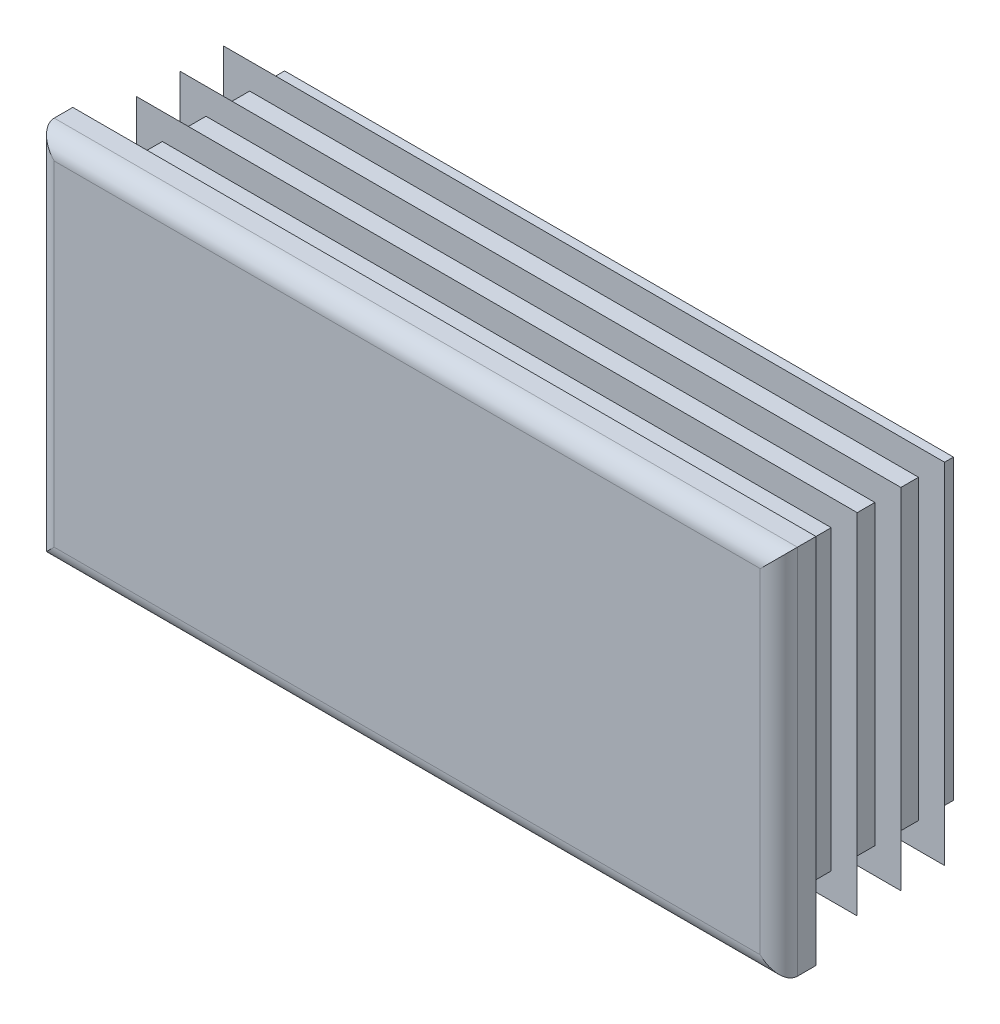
ISO-10303-21;
HEADER;
FILE_DESCRIPTION(('STEP AP214'),'2;1');
FILE_NAME('part.step','',(''),(''),'','','');
FILE_SCHEMA(('AUTOMOTIVE_DESIGN { 1 0 10303 214 1 1 1 1 }'));
ENDSEC;
DATA;
#1=APPLICATION_CONTEXT('core data for automotive mechanical design processes');
#2=APPLICATION_PROTOCOL_DEFINITION('international standard','automotive_design',2000,#1);
#3=PRODUCT_CONTEXT('',#1,'mechanical');
#4=PRODUCT('Part','Part','',(#3));
#5=PRODUCT_RELATED_PRODUCT_CATEGORY('part','',(#4));
#6=PRODUCT_DEFINITION_FORMATION('','',#4);
#7=PRODUCT_DEFINITION_CONTEXT('part definition',#1,'design');
#8=PRODUCT_DEFINITION('design','',#6,#7);
#9=PRODUCT_DEFINITION_SHAPE('','',#8);
#10=(LENGTH_UNIT() NAMED_UNIT(*) SI_UNIT(.MILLI.,.METRE.));
#11=(NAMED_UNIT(*) PLANE_ANGLE_UNIT() SI_UNIT($,.RADIAN.));
#12=(NAMED_UNIT(*) SI_UNIT($,.STERADIAN.) SOLID_ANGLE_UNIT());
#13=UNCERTAINTY_MEASURE_WITH_UNIT(LENGTH_MEASURE(1.E-05),#10,'distance_accuracy_value','');
#14=(GEOMETRIC_REPRESENTATION_CONTEXT(3) GLOBAL_UNCERTAINTY_ASSIGNED_CONTEXT((#13)) GLOBAL_UNIT_ASSIGNED_CONTEXT((#10,
#11,#12)) REPRESENTATION_CONTEXT('',''));
#15=CARTESIAN_POINT('',(0.,0.,0.));
#16=DIRECTION('',(0.,0.,1.));
#17=DIRECTION('',(1.,0.,0.));
#18=AXIS2_PLACEMENT_3D('',#15,#16,#17);
#19=CARTESIAN_POINT('',(47.5,-25.,5.));
#20=DIRECTION('',(0.,0.,-1.));
#21=DIRECTION('',(0.,1.,0.));
#22=AXIS2_PLACEMENT_3D('',#19,#20,#21);
#23=PLANE('',#22);
#24=DIRECTION('',(0.,1.,0.));
#25=VECTOR('',#24,1.);
#26=CARTESIAN_POINT('',(-47.5,-25.,5.));
#27=LINE('',#26,#25);
#28=CARTESIAN_POINT('',(-47.5,-22.5,5.));
#29=VERTEX_POINT('',#28);
#30=CARTESIAN_POINT('',(-47.5,22.5,5.));
#31=VERTEX_POINT('',#30);
#32=EDGE_CURVE('E310',#29,#31,#27,.T.);
#33=ORIENTED_EDGE('',*,*,#32,.F.);
#34=DIRECTION('',(-1.,0.,0.));
#35=VECTOR('',#34,1.);
#36=CARTESIAN_POINT('',(50.,-22.5,5.));
#37=LINE('',#36,#35);
#38=CARTESIAN_POINT('',(47.5,-22.5,5.));
#39=VERTEX_POINT('',#38);
#40=EDGE_CURVE('E482',#39,#29,#37,.T.);
#41=ORIENTED_EDGE('',*,*,#40,.F.);
#42=DIRECTION('',(0.,1.,0.));
#43=VECTOR('',#42,1.);
#44=CARTESIAN_POINT('',(47.5,-25.,5.));
#45=LINE('',#44,#43);
#46=CARTESIAN_POINT('',(47.5,22.5,5.));
#47=VERTEX_POINT('',#46);
#48=EDGE_CURVE('E305',#39,#47,#45,.T.);
#49=ORIENTED_EDGE('',*,*,#48,.T.);
#50=DIRECTION('',(-1.,0.,0.));
#51=VECTOR('',#50,1.);
#52=CARTESIAN_POINT('',(50.,22.5,5.));
#53=LINE('',#52,#51);
#54=EDGE_CURVE('E630',#47,#31,#53,.T.);
#55=ORIENTED_EDGE('',*,*,#54,.T.);
#56=EDGE_LOOP('',(#33,#41,#49,#55));
#57=FACE_BOUND('',#56,.T.);
#58=ADVANCED_FACE('F14',(#57),#23,.F.);
#59=CARTESIAN_POINT('',(-47.5,-25.,2.5));
#60=DIRECTION('',(0.,1.,0.));
#61=DIRECTION('',(-1.,0.,0.));
#62=AXIS2_PLACEMENT_3D('',#59,#60,#61);
#63=CYLINDRICAL_SURFACE('',#62,2.5);
#64=DIRECTION('',(0.,1.,0.));
#65=VECTOR('',#64,1.);
#66=CARTESIAN_POINT('',(-50.,-25.,2.5));
#67=LINE('',#66,#65);
#68=CARTESIAN_POINT('',(-50.,-25.,2.5));
#69=VERTEX_POINT('',#68);
#70=CARTESIAN_POINT('',(-50.,25.,2.5));
#71=VERTEX_POINT('',#70);
#72=EDGE_CURVE('E402',#69,#71,#67,.T.);
#73=ORIENTED_EDGE('',*,*,#72,.F.);
#74=CARTESIAN_POINT('',(-47.5,-22.5,2.5));
#75=DIRECTION('',(-0.707106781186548,0.707106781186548,0.));
#76=DIRECTION('',(0.707106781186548,0.707106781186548,0.));
#77=AXIS2_PLACEMENT_3D('',#74,#75,#76);
#78=ELLIPSE('',#77,3.53553390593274,2.5);
#79=EDGE_CURVE('E59',#69,#29,#78,.T.);
#80=ORIENTED_EDGE('',*,*,#79,.T.);
#81=ORIENTED_EDGE('',*,*,#32,.T.);
#82=CARTESIAN_POINT('',(-47.5,22.5,2.5));
#83=DIRECTION('',(0.707106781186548,0.707106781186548,0.));
#84=DIRECTION('',(-0.707106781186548,0.707106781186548,0.));
#85=AXIS2_PLACEMENT_3D('',#82,#83,#84);
#86=ELLIPSE('',#85,3.53553390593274,2.5);
#87=EDGE_CURVE('E306',#31,#71,#86,.F.);
#88=ORIENTED_EDGE('',*,*,#87,.T.);
#89=EDGE_LOOP('',(#73,#80,#81,#88));
#90=FACE_BOUND('',#89,.T.);
#91=ADVANCED_FACE('F16',(#90),#63,.T.);
#92=CARTESIAN_POINT('',(-50.,-25.,2.5));
#93=DIRECTION('',(1.,0.,0.));
#94=DIRECTION('',(0.,1.,0.));
#95=AXIS2_PLACEMENT_3D('',#92,#93,#94);
#96=PLANE('',#95);
#97=DIRECTION('',(0.,0.,-1.));
#98=VECTOR('',#97,1.);
#99=CARTESIAN_POINT('',(-50.,25.,2.5));
#100=LINE('',#99,#98);
#101=CARTESIAN_POINT('',(-50.,25.,0.));
#102=VERTEX_POINT('',#101);
#103=EDGE_CURVE('E615',#71,#102,#100,.T.);
#104=ORIENTED_EDGE('',*,*,#103,.T.);
#105=DIRECTION('',(0.,1.,0.));
#106=VECTOR('',#105,1.);
#107=CARTESIAN_POINT('',(-50.,-25.,0.));
#108=LINE('',#107,#106);
#109=CARTESIAN_POINT('',(-50.,-25.,0.));
#110=VERTEX_POINT('',#109);
#111=EDGE_CURVE('E400',#110,#102,#108,.T.);
#112=ORIENTED_EDGE('',*,*,#111,.F.);
#113=DIRECTION('',(0.,0.,-1.));
#114=VECTOR('',#113,1.);
#115=CARTESIAN_POINT('',(-50.,-25.,2.5));
#116=LINE('',#115,#114);
#117=EDGE_CURVE('E616',#69,#110,#116,.T.);
#118=ORIENTED_EDGE('',*,*,#117,.F.);
#119=ORIENTED_EDGE('',*,*,#72,.T.);
#120=EDGE_LOOP('',(#104,#112,#118,#119));
#121=FACE_BOUND('',#120,.T.);
#122=ADVANCED_FACE('F697',(#121),#96,.F.);
#123=CARTESIAN_POINT('',(-45.,-25.,0.));
#124=DIRECTION('',(1.,0.,0.));
#125=DIRECTION('',(0.,1.,0.));
#126=AXIS2_PLACEMENT_3D('',#123,#124,#125);
#127=PLANE('',#126);
#128=DIRECTION('',(0.,1.,0.));
#129=VECTOR('',#128,1.);
#130=CARTESIAN_POINT('',(-45.,-25.,0.));
#131=LINE('',#130,#129);
#132=CARTESIAN_POINT('',(-45.,-20.,0.));
#133=VERTEX_POINT('',#132);
#134=CARTESIAN_POINT('',(-45.,20.,0.));
#135=VERTEX_POINT('',#134);
#136=EDGE_CURVE('E397',#133,#135,#131,.T.);
#137=ORIENTED_EDGE('',*,*,#136,.T.);
#138=DIRECTION('',(0.,0.,-1.));
#139=VECTOR('',#138,1.);
#140=CARTESIAN_POINT('',(-45.,20.,0.));
#141=LINE('',#140,#139);
#142=CARTESIAN_POINT('',(-45.,20.,-1.175));
#143=VERTEX_POINT('',#142);
#144=EDGE_CURVE('E495',#135,#143,#141,.T.);
#145=ORIENTED_EDGE('',*,*,#144,.T.);
#146=DIRECTION('',(0.,1.,0.));
#147=VECTOR('',#146,1.);
#148=CARTESIAN_POINT('',(-45.,-25.,-1.175));
#149=LINE('',#148,#147);
#150=CARTESIAN_POINT('',(-45.,-20.,-1.175));
#151=VERTEX_POINT('',#150);
#152=EDGE_CURVE('E394',#151,#143,#149,.T.);
#153=ORIENTED_EDGE('',*,*,#152,.F.);
#154=DIRECTION('',(0.,0.,1.));
#155=VECTOR('',#154,1.);
#156=CARTESIAN_POINT('',(-45.,-20.,0.));
#157=LINE('',#156,#155);
#158=EDGE_CURVE('E489',#151,#133,#157,.T.);
#159=ORIENTED_EDGE('',*,*,#158,.T.);
#160=EDGE_LOOP('',(#137,#145,#153,#159));
#161=FACE_BOUND('',#160,.T.);
#162=ADVANCED_FACE('F787',(#161),#127,.F.);
#163=CARTESIAN_POINT('',(-48.5,-25.,-1.175));
#164=DIRECTION('',(0.342020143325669,0.,0.939692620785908));
#165=DIRECTION('',(-0.939692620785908,0.,0.342020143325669));
#166=AXIS2_PLACEMENT_3D('',#163,#164,#165);
#167=PLANE('',#166);
#168=DIRECTION('',(0.,1.,0.));
#169=VECTOR('',#168,1.);
#170=CARTESIAN_POINT('',(-48.5,-25.,-1.175));
#171=LINE('',#170,#169);
#172=CARTESIAN_POINT('',(-48.5,-23.5,-1.175));
#173=VERTEX_POINT('',#172);
#174=CARTESIAN_POINT('',(-48.5,23.5,-1.175));
#175=VERTEX_POINT('',#174);
#176=EDGE_CURVE('E392',#173,#175,#171,.T.);
#177=ORIENTED_EDGE('',*,*,#176,.T.);
#178=DIRECTION('',(0.844349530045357,-0.438895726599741,-0.307318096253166));
#179=VECTOR('',#178,1.);
#180=CARTESIAN_POINT('',(-30.5268020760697,14.1574712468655,-7.71670905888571));
#181=LINE('',#180,#179);
#182=CARTESIAN_POINT('',(-45.,21.6806882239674,-2.44889581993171));
#183=VERTEX_POINT('',#182);
#184=EDGE_CURVE('E519',#175,#183,#181,.T.);
#185=ORIENTED_EDGE('',*,*,#184,.T.);
#186=DIRECTION('',(0.,1.,0.));
#187=VECTOR('',#186,1.);
#188=CARTESIAN_POINT('',(-45.,-25.,-2.44889581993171));
#189=LINE('',#188,#187);
#190=CARTESIAN_POINT('',(-45.,-21.6806882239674,-2.44889581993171));
#191=VERTEX_POINT('',#190);
#192=EDGE_CURVE('E389',#191,#183,#189,.T.);
#193=ORIENTED_EDGE('',*,*,#192,.F.);
#194=DIRECTION('',(-0.844349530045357,-0.438895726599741,0.307318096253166));
#195=VECTOR('',#194,1.);
#196=CARTESIAN_POINT('',(-49.0558721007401,-23.7889441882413,-0.972679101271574));
#197=LINE('',#196,#195);
#198=EDGE_CURVE('E507',#191,#173,#197,.T.);
#199=ORIENTED_EDGE('',*,*,#198,.T.);
#200=EDGE_LOOP('',(#177,#185,#193,#199));
#201=FACE_BOUND('',#200,.T.);
#202=ADVANCED_FACE('F783',(#201),#167,.F.);
#203=CARTESIAN_POINT('',(-45.,-25.,-2.44889581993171));
#204=DIRECTION('',(1.,0.,0.));
#205=DIRECTION('',(0.,1.,0.));
#206=AXIS2_PLACEMENT_3D('',#203,#204,#205);
#207=PLANE('',#206);
#208=ORIENTED_EDGE('',*,*,#192,.T.);
#209=DIRECTION('',(0.,-0.819152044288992,-0.573576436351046));
#210=VECTOR('',#209,1.);
#211=CARTESIAN_POINT('',(-45.,-9.64252372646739,-24.3816449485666));
#212=LINE('',#211,#210);
#213=CARTESIAN_POINT('',(-45.,20.,-3.62572638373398));
#214=VERTEX_POINT('',#213);
#215=EDGE_CURVE('E516',#183,#214,#212,.T.);
#216=ORIENTED_EDGE('',*,*,#215,.T.);
#217=DIRECTION('',(0.,0.,-1.));
#218=VECTOR('',#217,1.);
#219=CARTESIAN_POINT('',(-45.,20.,-2.44889581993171));
#220=LINE('',#219,#218);
#221=CARTESIAN_POINT('',(-45.,20.,-7.05));
#222=VERTEX_POINT('',#221);
#223=EDGE_CURVE('E525',#214,#222,#220,.T.);
#224=ORIENTED_EDGE('',*,*,#223,.T.);
#225=DIRECTION('',(0.,1.,0.));
#226=VECTOR('',#225,1.);
#227=CARTESIAN_POINT('',(-45.,-25.,-7.05));
#228=LINE('',#227,#226);
#229=CARTESIAN_POINT('',(-45.,-20.,-7.05));
#230=VERTEX_POINT('',#229);
#231=EDGE_CURVE('E386',#230,#222,#228,.T.);
#232=ORIENTED_EDGE('',*,*,#231,.F.);
#233=DIRECTION('',(0.,0.,1.));
#234=VECTOR('',#233,1.);
#235=CARTESIAN_POINT('',(-45.,-20.,-2.44889581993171));
#236=LINE('',#235,#234);
#237=CARTESIAN_POINT('',(-45.,-20.,-3.62572638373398));
#238=VERTEX_POINT('',#237);
#239=EDGE_CURVE('E522',#230,#238,#236,.T.);
#240=ORIENTED_EDGE('',*,*,#239,.T.);
#241=DIRECTION('',(0.,-0.819152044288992,0.573576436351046));
#242=VECTOR('',#241,1.);
#243=CARTESIAN_POINT('',(-45.,-23.9079798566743,-0.889329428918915));
#244=LINE('',#243,#242);
#245=EDGE_CURVE('E504',#238,#191,#244,.T.);
#246=ORIENTED_EDGE('',*,*,#245,.T.);
#247=EDGE_LOOP('',(#208,#216,#224,#232,#240,#246));
#248=FACE_BOUND('',#247,.T.);
#249=ADVANCED_FACE('F779',(#248),#207,.F.);
#250=CARTESIAN_POINT('',(-48.5,-25.,-7.05));
#251=DIRECTION('',(0.342020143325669,0.,0.939692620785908));
#252=DIRECTION('',(-0.939692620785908,0.,0.342020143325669));
#253=AXIS2_PLACEMENT_3D('',#250,#251,#252);
#254=PLANE('',#253);
#255=DIRECTION('',(0.,1.,0.));
#256=VECTOR('',#255,1.);
#257=CARTESIAN_POINT('',(-48.5,-25.,-7.05));
#258=LINE('',#257,#256);
#259=CARTESIAN_POINT('',(-48.5,-23.5,-7.05));
#260=VERTEX_POINT('',#259);
#261=CARTESIAN_POINT('',(-48.5,23.5,-7.05));
#262=VERTEX_POINT('',#261);
#263=EDGE_CURVE('E384',#260,#262,#258,.T.);
#264=ORIENTED_EDGE('',*,*,#263,.T.);
#265=DIRECTION('',(0.844349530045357,-0.438895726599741,-0.307318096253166));
#266=VECTOR('',#265,1.);
#267=CARTESIAN_POINT('',(-30.5268020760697,14.1574712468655,-13.5917090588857));
#268=LINE('',#267,#266);
#269=CARTESIAN_POINT('',(-45.,21.6806882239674,-8.32389581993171));
#270=VERTEX_POINT('',#269);
#271=EDGE_CURVE('E549',#262,#270,#268,.T.);
#272=ORIENTED_EDGE('',*,*,#271,.T.);
#273=DIRECTION('',(0.,1.,0.));
#274=VECTOR('',#273,1.);
#275=CARTESIAN_POINT('',(-45.,-25.,-8.32389581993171));
#276=LINE('',#275,#274);
#277=CARTESIAN_POINT('',(-45.,-21.6806882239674,-8.32389581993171));
#278=VERTEX_POINT('',#277);
#279=EDGE_CURVE('E381',#278,#270,#276,.T.);
#280=ORIENTED_EDGE('',*,*,#279,.F.);
#281=DIRECTION('',(-0.844349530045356,-0.438895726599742,0.307318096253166));
#282=VECTOR('',#281,1.);
#283=CARTESIAN_POINT('',(-49.0558721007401,-23.7889441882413,-6.84767910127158));
#284=LINE('',#283,#282);
#285=EDGE_CURVE('E537',#278,#260,#284,.T.);
#286=ORIENTED_EDGE('',*,*,#285,.T.);
#287=EDGE_LOOP('',(#264,#272,#280,#286));
#288=FACE_BOUND('',#287,.T.);
#289=ADVANCED_FACE('F775',(#288),#254,.F.);
#290=CARTESIAN_POINT('',(-45.,-25.,-8.32389581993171));
#291=DIRECTION('',(1.,0.,0.));
#292=DIRECTION('',(0.,1.,0.));
#293=AXIS2_PLACEMENT_3D('',#290,#291,#292);
#294=PLANE('',#293);
#295=ORIENTED_EDGE('',*,*,#279,.T.);
#296=DIRECTION('',(0.,-0.819152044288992,-0.573576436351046));
#297=VECTOR('',#296,1.);
#298=CARTESIAN_POINT('',(-45.,-9.6425237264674,-30.2566449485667));
#299=LINE('',#298,#297);
#300=CARTESIAN_POINT('',(-45.,20.,-9.50072638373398));
#301=VERTEX_POINT('',#300);
#302=EDGE_CURVE('E546',#270,#301,#299,.T.);
#303=ORIENTED_EDGE('',*,*,#302,.T.);
#304=DIRECTION('',(0.,0.,-1.));
#305=VECTOR('',#304,1.);
#306=CARTESIAN_POINT('',(-45.,20.,-8.32389581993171));
#307=LINE('',#306,#305);
#308=CARTESIAN_POINT('',(-45.,20.,-12.925));
#309=VERTEX_POINT('',#308);
#310=EDGE_CURVE('E555',#301,#309,#307,.T.);
#311=ORIENTED_EDGE('',*,*,#310,.T.);
#312=DIRECTION('',(0.,1.,0.));
#313=VECTOR('',#312,1.);
#314=CARTESIAN_POINT('',(-45.,-25.,-12.925));
#315=LINE('',#314,#313);
#316=CARTESIAN_POINT('',(-45.,-20.,-12.925));
#317=VERTEX_POINT('',#316);
#318=EDGE_CURVE('E378',#317,#309,#315,.T.);
#319=ORIENTED_EDGE('',*,*,#318,.F.);
#320=DIRECTION('',(0.,0.,1.));
#321=VECTOR('',#320,1.);
#322=CARTESIAN_POINT('',(-45.,-20.,-8.32389581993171));
#323=LINE('',#322,#321);
#324=CARTESIAN_POINT('',(-45.,-20.,-9.50072638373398));
#325=VERTEX_POINT('',#324);
#326=EDGE_CURVE('E552',#317,#325,#323,.T.);
#327=ORIENTED_EDGE('',*,*,#326,.T.);
#328=DIRECTION('',(0.,-0.819152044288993,0.573576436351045));
#329=VECTOR('',#328,1.);
#330=CARTESIAN_POINT('',(-45.,-23.9079798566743,-6.76432942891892));
#331=LINE('',#330,#329);
#332=EDGE_CURVE('E534',#325,#278,#331,.T.);
#333=ORIENTED_EDGE('',*,*,#332,.T.);
#334=EDGE_LOOP('',(#295,#303,#311,#319,#327,#333));
#335=FACE_BOUND('',#334,.T.);
#336=ADVANCED_FACE('F771',(#335),#294,.F.);
#337=CARTESIAN_POINT('',(-48.5,-25.,-12.925));
#338=DIRECTION('',(0.342020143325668,0.,0.939692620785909));
#339=DIRECTION('',(-0.939692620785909,0.,0.342020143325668));
#340=AXIS2_PLACEMENT_3D('',#337,#338,#339);
#341=PLANE('',#340);
#342=DIRECTION('',(0.,1.,0.));
#343=VECTOR('',#342,1.);
#344=CARTESIAN_POINT('',(-48.5,-25.,-12.925));
#345=LINE('',#344,#343);
#346=CARTESIAN_POINT('',(-48.5,-23.5,-12.925));
#347=VERTEX_POINT('',#346);
#348=CARTESIAN_POINT('',(-48.5,23.5,-12.925));
#349=VERTEX_POINT('',#348);
#350=EDGE_CURVE('E376',#347,#349,#345,.T.);
#351=ORIENTED_EDGE('',*,*,#350,.T.);
#352=DIRECTION('',(0.844349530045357,-0.438895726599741,-0.307318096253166));
#353=VECTOR('',#352,1.);
#354=CARTESIAN_POINT('',(-30.5268020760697,14.1574712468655,-19.4667090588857));
#355=LINE('',#354,#353);
#356=CARTESIAN_POINT('',(-45.,21.6806882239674,-14.1988958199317));
#357=VERTEX_POINT('',#356);
#358=EDGE_CURVE('E579',#349,#357,#355,.T.);
#359=ORIENTED_EDGE('',*,*,#358,.T.);
#360=DIRECTION('',(0.,1.,0.));
#361=VECTOR('',#360,1.);
#362=CARTESIAN_POINT('',(-45.,-25.,-14.1988958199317));
#363=LINE('',#362,#361);
#364=CARTESIAN_POINT('',(-45.,-21.6806882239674,-14.1988958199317));
#365=VERTEX_POINT('',#364);
#366=EDGE_CURVE('E373',#365,#357,#363,.T.);
#367=ORIENTED_EDGE('',*,*,#366,.F.);
#368=DIRECTION('',(-0.844349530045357,-0.43889572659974,0.307318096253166));
#369=VECTOR('',#368,1.);
#370=CARTESIAN_POINT('',(-49.0558721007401,-23.7889441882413,-12.7226791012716));
#371=LINE('',#370,#369);
#372=EDGE_CURVE('E567',#365,#347,#371,.T.);
#373=ORIENTED_EDGE('',*,*,#372,.T.);
#374=EDGE_LOOP('',(#351,#359,#367,#373));
#375=FACE_BOUND('',#374,.T.);
#376=ADVANCED_FACE('F767',(#375),#341,.F.);
#377=CARTESIAN_POINT('',(-45.,-25.,-14.1988958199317));
#378=DIRECTION('',(1.,0.,0.));
#379=DIRECTION('',(0.,1.,0.));
#380=AXIS2_PLACEMENT_3D('',#377,#378,#379);
#381=PLANE('',#380);
#382=ORIENTED_EDGE('',*,*,#366,.T.);
#383=DIRECTION('',(0.,-0.819152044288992,-0.573576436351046));
#384=VECTOR('',#383,1.);
#385=CARTESIAN_POINT('',(-45.,-9.64252372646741,-36.1316449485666));
#386=LINE('',#385,#384);
#387=CARTESIAN_POINT('',(-45.,20.,-15.375726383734));
#388=VERTEX_POINT('',#387);
#389=EDGE_CURVE('E576',#357,#388,#386,.T.);
#390=ORIENTED_EDGE('',*,*,#389,.T.);
#391=DIRECTION('',(0.,0.,-1.));
#392=VECTOR('',#391,1.);
#393=CARTESIAN_POINT('',(-45.,20.,-14.1988958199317));
#394=LINE('',#393,#392);
#395=CARTESIAN_POINT('',(-45.,20.,-18.8));
#396=VERTEX_POINT('',#395);
#397=EDGE_CURVE('E585',#388,#396,#394,.T.);
#398=ORIENTED_EDGE('',*,*,#397,.T.);
#399=DIRECTION('',(0.,1.,0.));
#400=VECTOR('',#399,1.);
#401=CARTESIAN_POINT('',(-45.,-25.,-18.8));
#402=LINE('',#401,#400);
#403=CARTESIAN_POINT('',(-45.,-20.,-18.8));
#404=VERTEX_POINT('',#403);
#405=EDGE_CURVE('E370',#404,#396,#402,.T.);
#406=ORIENTED_EDGE('',*,*,#405,.F.);
#407=DIRECTION('',(0.,0.,1.));
#408=VECTOR('',#407,1.);
#409=CARTESIAN_POINT('',(-45.,-20.,-14.1988958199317));
#410=LINE('',#409,#408);
#411=CARTESIAN_POINT('',(-45.,-20.,-15.375726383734));
#412=VERTEX_POINT('',#411);
#413=EDGE_CURVE('E582',#404,#412,#410,.T.);
#414=ORIENTED_EDGE('',*,*,#413,.T.);
#415=DIRECTION('',(0.,-0.819152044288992,0.573576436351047));
#416=VECTOR('',#415,1.);
#417=CARTESIAN_POINT('',(-45.,-23.9079798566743,-12.6393294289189));
#418=LINE('',#417,#416);
#419=EDGE_CURVE('E564',#412,#365,#418,.T.);
#420=ORIENTED_EDGE('',*,*,#419,.T.);
#421=EDGE_LOOP('',(#382,#390,#398,#406,#414,#420));
#422=FACE_BOUND('',#421,.T.);
#423=ADVANCED_FACE('F764',(#422),#381,.F.);
#424=CARTESIAN_POINT('',(-48.5,-25.,-18.8));
#425=DIRECTION('',(0.342020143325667,0.,0.939692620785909));
#426=DIRECTION('',(-0.939692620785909,0.,0.342020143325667));
#427=AXIS2_PLACEMENT_3D('',#424,#425,#426);
#428=PLANE('',#427);
#429=DIRECTION('',(0.,1.,0.));
#430=VECTOR('',#429,1.);
#431=CARTESIAN_POINT('',(-48.5,-25.,-18.8));
#432=LINE('',#431,#430);
#433=CARTESIAN_POINT('',(-48.5,-23.5,-18.8));
#434=VERTEX_POINT('',#433);
#435=CARTESIAN_POINT('',(-48.5,23.5,-18.8));
#436=VERTEX_POINT('',#435);
#437=EDGE_CURVE('E368',#434,#436,#432,.T.);
#438=ORIENTED_EDGE('',*,*,#437,.T.);
#439=DIRECTION('',(0.844349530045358,-0.438895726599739,-0.307318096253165));
#440=VECTOR('',#439,1.);
#441=CARTESIAN_POINT('',(-30.5268020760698,14.1574712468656,-25.3417090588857));
#442=LINE('',#441,#440);
#443=CARTESIAN_POINT('',(-45.,21.6806882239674,-20.0738958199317));
#444=VERTEX_POINT('',#443);
#445=EDGE_CURVE('E607',#436,#444,#442,.T.);
#446=ORIENTED_EDGE('',*,*,#445,.T.);
#447=DIRECTION('',(0.,1.,0.));
#448=VECTOR('',#447,1.);
#449=CARTESIAN_POINT('',(-45.,-25.,-20.0738958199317));
#450=LINE('',#449,#448);
#451=CARTESIAN_POINT('',(-45.,-21.6806882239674,-20.0738958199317));
#452=VERTEX_POINT('',#451);
#453=EDGE_CURVE('E365',#452,#444,#450,.T.);
#454=ORIENTED_EDGE('',*,*,#453,.F.);
#455=DIRECTION('',(-0.844349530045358,-0.43889572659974,0.307318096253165));
#456=VECTOR('',#455,1.);
#457=CARTESIAN_POINT('',(-49.0558721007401,-23.7889441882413,-18.5976791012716));
#458=LINE('',#457,#456);
#459=EDGE_CURVE('E595',#452,#434,#458,.T.);
#460=ORIENTED_EDGE('',*,*,#459,.T.);
#461=EDGE_LOOP('',(#438,#446,#454,#460));
#462=FACE_BOUND('',#461,.T.);
#463=ADVANCED_FACE('F675',(#462),#428,.F.);
#464=CARTESIAN_POINT('',(-45.,-25.,-20.0738958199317));
#465=DIRECTION('',(1.,0.,0.));
#466=DIRECTION('',(0.,1.,0.));
#467=AXIS2_PLACEMENT_3D('',#464,#465,#466);
#468=PLANE('',#467);
#469=ORIENTED_EDGE('',*,*,#453,.T.);
#470=DIRECTION('',(0.,-0.819152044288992,-0.573576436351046));
#471=VECTOR('',#470,1.);
#472=CARTESIAN_POINT('',(-45.,-9.64252372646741,-42.0066449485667));
#473=LINE('',#472,#471);
#474=CARTESIAN_POINT('',(-45.,20.,-21.250726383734));
#475=VERTEX_POINT('',#474);
#476=EDGE_CURVE('E604',#444,#475,#473,.T.);
#477=ORIENTED_EDGE('',*,*,#476,.T.);
#478=DIRECTION('',(0.,0.,-1.));
#479=VECTOR('',#478,1.);
#480=CARTESIAN_POINT('',(-45.,20.,-20.0738958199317));
#481=LINE('',#480,#479);
#482=CARTESIAN_POINT('',(-45.,20.,-23.5));
#483=VERTEX_POINT('',#482);
#484=EDGE_CURVE('E613',#475,#483,#481,.T.);
#485=ORIENTED_EDGE('',*,*,#484,.T.);
#486=DIRECTION('',(0.,1.,0.));
#487=VECTOR('',#486,1.);
#488=CARTESIAN_POINT('',(-45.,-25.,-23.5));
#489=LINE('',#488,#487);
#490=CARTESIAN_POINT('',(-45.,-20.,-23.5));
#491=VERTEX_POINT('',#490);
#492=EDGE_CURVE('E362',#491,#483,#489,.T.);
#493=ORIENTED_EDGE('',*,*,#492,.F.);
#494=DIRECTION('',(0.,0.,1.));
#495=VECTOR('',#494,1.);
#496=CARTESIAN_POINT('',(-45.,-20.,-20.0738958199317));
#497=LINE('',#496,#495);
#498=CARTESIAN_POINT('',(-45.,-20.,-21.250726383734));
#499=VERTEX_POINT('',#498);
#500=EDGE_CURVE('E610',#491,#499,#497,.T.);
#501=ORIENTED_EDGE('',*,*,#500,.T.);
#502=DIRECTION('',(0.,-0.819152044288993,0.573576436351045));
#503=VECTOR('',#502,1.);
#504=CARTESIAN_POINT('',(-45.,-23.9079798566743,-18.5143294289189));
#505=LINE('',#504,#503);
#506=EDGE_CURVE('E592',#499,#452,#505,.T.);
#507=ORIENTED_EDGE('',*,*,#506,.T.);
#508=EDGE_LOOP('',(#469,#477,#485,#493,#501,#507));
#509=FACE_BOUND('',#508,.T.);
#510=ADVANCED_FACE('F677',(#509),#468,.F.);
#511=CARTESIAN_POINT('',(-45.,-25.,-23.5));
#512=DIRECTION('',(0.,0.,1.));
#513=DIRECTION('',(0.,-1.,0.));
#514=AXIS2_PLACEMENT_3D('',#511,#512,#513);
#515=PLANE('',#514);
#516=ORIENTED_EDGE('',*,*,#492,.T.);
#517=DIRECTION('',(-1.,0.,0.));
#518=VECTOR('',#517,1.);
#519=CARTESIAN_POINT('',(50.,20.,-23.5));
#520=LINE('',#519,#518);
#521=CARTESIAN_POINT('',(45.,20.,-23.5));
#522=VERTEX_POINT('',#521);
#523=EDGE_CURVE('E438',#522,#483,#520,.T.);
#524=ORIENTED_EDGE('',*,*,#523,.F.);
#525=DIRECTION('',(0.,1.,0.));
#526=VECTOR('',#525,1.);
#527=CARTESIAN_POINT('',(45.,-25.,-23.5));
#528=LINE('',#527,#526);
#529=CARTESIAN_POINT('',(45.,-20.,-23.5));
#530=VERTEX_POINT('',#529);
#531=EDGE_CURVE('E359',#530,#522,#528,.T.);
#532=ORIENTED_EDGE('',*,*,#531,.F.);
#533=DIRECTION('',(-1.,0.,0.));
#534=VECTOR('',#533,1.);
#535=CARTESIAN_POINT('',(50.,-20.,-23.5));
#536=LINE('',#535,#534);
#537=EDGE_CURVE('E436',#530,#491,#536,.T.);
#538=ORIENTED_EDGE('',*,*,#537,.T.);
#539=EDGE_LOOP('',(#516,#524,#532,#538));
#540=FACE_BOUND('',#539,.T.);
#541=ADVANCED_FACE('F435',(#540),#515,.F.);
#542=CARTESIAN_POINT('',(45.,-25.,-23.5));
#543=DIRECTION('',(-1.,0.,0.));
#544=DIRECTION('',(0.,-1.,0.));
#545=AXIS2_PLACEMENT_3D('',#542,#543,#544);
#546=PLANE('',#545);
#547=DIRECTION('',(0.,0.,1.));
#548=VECTOR('',#547,1.);
#549=CARTESIAN_POINT('',(45.,20.,-23.5));
#550=LINE('',#549,#548);
#551=CARTESIAN_POINT('',(45.,20.,-21.250726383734));
#552=VERTEX_POINT('',#551);
#553=EDGE_CURVE('E9',#522,#552,#550,.T.);
#554=ORIENTED_EDGE('',*,*,#553,.T.);
#555=DIRECTION('',(0.,0.819152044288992,0.573576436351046));
#556=VECTOR('',#555,1.);
#557=CARTESIAN_POINT('',(45.,-11.2522661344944,-43.133798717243));
#558=LINE('',#557,#556);
#559=CARTESIAN_POINT('',(45.,21.6806882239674,-20.0738958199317));
#560=VERTEX_POINT('',#559);
#561=EDGE_CURVE('E601',#552,#560,#558,.T.);
#562=ORIENTED_EDGE('',*,*,#561,.T.);
#563=DIRECTION('',(0.,1.,0.));
#564=VECTOR('',#563,1.);
#565=CARTESIAN_POINT('',(45.,-25.,-20.0738958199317));
#566=LINE('',#565,#564);
#567=CARTESIAN_POINT('',(45.,-21.6806882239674,-20.0738958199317));
#568=VERTEX_POINT('',#567);
#569=EDGE_CURVE('E356',#568,#560,#566,.T.);
#570=ORIENTED_EDGE('',*,*,#569,.F.);
#571=DIRECTION('',(0.,0.819152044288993,-0.573576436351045));
#572=VECTOR('',#571,1.);
#573=CARTESIAN_POINT('',(45.,-22.2982374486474,-19.6414831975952));
#574=LINE('',#573,#572);
#575=CARTESIAN_POINT('',(45.,-20.,-21.250726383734));
#576=VERTEX_POINT('',#575);
#577=EDGE_CURVE('E428',#568,#576,#574,.T.);
#578=ORIENTED_EDGE('',*,*,#577,.T.);
#579=DIRECTION('',(0.,0.,-1.));
#580=VECTOR('',#579,1.);
#581=CARTESIAN_POINT('',(45.,-20.,-23.5));
#582=LINE('',#581,#580);
#583=EDGE_CURVE('E23',#576,#530,#582,.T.);
#584=ORIENTED_EDGE('',*,*,#583,.T.);
#585=ORIENTED_EDGE('',*,*,#531,.T.);
#586=EDGE_LOOP('',(#554,#562,#570,#578,#584,#585));
#587=FACE_BOUND('',#586,.T.);
#588=ADVANCED_FACE('F426',(#587),#546,.F.);
#589=CARTESIAN_POINT('',(45.,-25.,-20.0738958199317));
#590=DIRECTION('',(-0.342020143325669,0.,0.939692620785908));
#591=DIRECTION('',(-0.939692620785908,0.,-0.342020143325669));
#592=AXIS2_PLACEMENT_3D('',#589,#590,#591);
#593=PLANE('',#592);
#594=ORIENTED_EDGE('',*,*,#569,.T.);
#595=DIRECTION('',(0.844349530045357,0.438895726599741,0.307318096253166));
#596=VECTOR('',#595,1.);
#597=CARTESIAN_POINT('',(27.701005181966,12.6886125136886,-26.3702150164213));
#598=LINE('',#597,#596);
#599=CARTESIAN_POINT('',(48.5,23.5,-18.8));
#600=VERTEX_POINT('',#599);
#601=EDGE_CURVE('E598',#560,#600,#598,.T.);
#602=ORIENTED_EDGE('',*,*,#601,.T.);
#603=DIRECTION('',(0.,1.,0.));
#604=VECTOR('',#603,1.);
#605=CARTESIAN_POINT('',(48.5,-25.,-18.8));
#606=LINE('',#605,#604);
#607=CARTESIAN_POINT('',(48.5,-23.5,-18.8));
#608=VERTEX_POINT('',#607);
#609=EDGE_CURVE('E353',#608,#600,#606,.T.);
#610=ORIENTED_EDGE('',*,*,#609,.F.);
#611=DIRECTION('',(-0.844349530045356,0.438895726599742,-0.307318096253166));
#612=VECTOR('',#611,1.);
#613=CARTESIAN_POINT('',(46.2300752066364,-22.3200854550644,-19.6261850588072));
#614=LINE('',#613,#612);
#615=EDGE_CURVE('E588',#608,#568,#614,.T.);
#616=ORIENTED_EDGE('',*,*,#615,.T.);
#617=EDGE_LOOP('',(#594,#602,#610,#616));
#618=FACE_BOUND('',#617,.T.);
#619=ADVANCED_FACE('F752',(#618),#593,.F.);
#620=CARTESIAN_POINT('',(48.5,-25.,-18.8));
#621=DIRECTION('',(0.,0.,-1.));
#622=DIRECTION('',(0.,1.,0.));
#623=AXIS2_PLACEMENT_3D('',#620,#621,#622);
#624=PLANE('',#623);
#625=ORIENTED_EDGE('',*,*,#609,.T.);
#626=DIRECTION('',(-1.,0.,0.));
#627=VECTOR('',#626,1.);
#628=CARTESIAN_POINT('',(50.,23.5,-18.8));
#629=LINE('',#628,#627);
#630=EDGE_CURVE('E444',#600,#436,#629,.T.);
#631=ORIENTED_EDGE('',*,*,#630,.T.);
#632=ORIENTED_EDGE('',*,*,#437,.F.);
#633=DIRECTION('',(-1.,0.,0.));
#634=VECTOR('',#633,1.);
#635=CARTESIAN_POINT('',(50.,-23.5,-18.8));
#636=LINE('',#635,#634);
#637=EDGE_CURVE('E451',#608,#434,#636,.T.);
#638=ORIENTED_EDGE('',*,*,#637,.F.);
#639=EDGE_LOOP('',(#625,#631,#632,#638));
#640=FACE_BOUND('',#639,.T.);
#641=ORIENTED_EDGE('',*,*,#405,.T.);
#642=DIRECTION('',(-1.,0.,0.));
#643=VECTOR('',#642,1.);
#644=CARTESIAN_POINT('',(50.,20.,-18.8));
#645=LINE('',#644,#643);
#646=CARTESIAN_POINT('',(45.,20.,-18.8));
#647=VERTEX_POINT('',#646);
#648=EDGE_CURVE('E663',#647,#396,#645,.T.);
#649=ORIENTED_EDGE('',*,*,#648,.F.);
#650=DIRECTION('',(0.,1.,0.));
#651=VECTOR('',#650,1.);
#652=CARTESIAN_POINT('',(45.,-25.,-18.8));
#653=LINE('',#652,#651);
#654=CARTESIAN_POINT('',(45.,-20.,-18.8));
#655=VERTEX_POINT('',#654);
#656=EDGE_CURVE('E350',#655,#647,#653,.T.);
#657=ORIENTED_EDGE('',*,*,#656,.F.);
#658=DIRECTION('',(-1.,0.,0.));
#659=VECTOR('',#658,1.);
#660=CARTESIAN_POINT('',(50.,-20.,-18.8));
#661=LINE('',#660,#659);
#662=EDGE_CURVE('E453',#655,#404,#661,.T.);
#663=ORIENTED_EDGE('',*,*,#662,.T.);
#664=EDGE_LOOP('',(#641,#649,#657,#663));
#665=FACE_BOUND('',#664,.T.);
#666=ADVANCED_FACE('F667',(#640,#665),#624,.F.);
#667=CARTESIAN_POINT('',(45.,-25.,-18.8));
#668=DIRECTION('',(-1.,0.,0.));
#669=DIRECTION('',(0.,-1.,0.));
#670=AXIS2_PLACEMENT_3D('',#667,#668,#669);
#671=PLANE('',#670);
#672=DIRECTION('',(0.,0.,1.));
#673=VECTOR('',#672,1.);
#674=CARTESIAN_POINT('',(45.,20.,-18.8));
#675=LINE('',#674,#673);
#676=CARTESIAN_POINT('',(45.,20.,-15.375726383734));
#677=VERTEX_POINT('',#676);
#678=EDGE_CURVE('E420',#647,#677,#675,.T.);
#679=ORIENTED_EDGE('',*,*,#678,.T.);
#680=DIRECTION('',(0.,0.819152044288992,0.573576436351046));
#681=VECTOR('',#680,1.);
#682=CARTESIAN_POINT('',(45.,-11.8043355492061,-37.6453618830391));
#683=LINE('',#682,#681);
#684=CARTESIAN_POINT('',(45.,21.6806882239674,-14.1988958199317));
#685=VERTEX_POINT('',#684);
#686=EDGE_CURVE('E573',#677,#685,#683,.T.);
#687=ORIENTED_EDGE('',*,*,#686,.T.);
#688=DIRECTION('',(0.,1.,0.));
#689=VECTOR('',#688,1.);
#690=CARTESIAN_POINT('',(45.,-25.,-14.1988958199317));
#691=LINE('',#690,#689);
#692=CARTESIAN_POINT('',(45.,-21.6806882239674,-14.1988958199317));
#693=VERTEX_POINT('',#692);
#694=EDGE_CURVE('E347',#693,#685,#691,.T.);
#695=ORIENTED_EDGE('',*,*,#694,.F.);
#696=DIRECTION('',(0.,0.819152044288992,-0.573576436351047));
#697=VECTOR('',#696,1.);
#698=CARTESIAN_POINT('',(45.,-21.7461680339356,-14.1530463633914));
#699=LINE('',#698,#697);
#700=CARTESIAN_POINT('',(45.,-20.,-15.375726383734));
#701=VERTEX_POINT('',#700);
#702=EDGE_CURVE('E561',#693,#701,#699,.T.);
#703=ORIENTED_EDGE('',*,*,#702,.T.);
#704=DIRECTION('',(0.,0.,-1.));
#705=VECTOR('',#704,1.);
#706=CARTESIAN_POINT('',(45.,-20.,-18.8));
#707=LINE('',#706,#705);
#708=EDGE_CURVE('E417',#701,#655,#707,.T.);
#709=ORIENTED_EDGE('',*,*,#708,.T.);
#710=ORIENTED_EDGE('',*,*,#656,.T.);
#711=EDGE_LOOP('',(#679,#687,#695,#703,#709,#710));
#712=FACE_BOUND('',#711,.T.);
#713=ADVANCED_FACE('F745',(#712),#671,.F.);
#714=CARTESIAN_POINT('',(45.,-25.,-14.1988958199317));
#715=DIRECTION('',(-0.342020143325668,0.,0.939692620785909));
#716=DIRECTION('',(-0.939692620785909,0.,-0.342020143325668));
#717=AXIS2_PLACEMENT_3D('',#714,#715,#716);
#718=PLANE('',#717);
#719=ORIENTED_EDGE('',*,*,#694,.T.);
#720=DIRECTION('',(0.844349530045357,0.438895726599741,0.307318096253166));
#721=VECTOR('',#720,1.);
#722=CARTESIAN_POINT('',(27.7010051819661,12.6886125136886,-20.4952150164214));
#723=LINE('',#722,#721);
#724=CARTESIAN_POINT('',(48.5,23.5,-12.925));
#725=VERTEX_POINT('',#724);
#726=EDGE_CURVE('E570',#685,#725,#723,.T.);
#727=ORIENTED_EDGE('',*,*,#726,.T.);
#728=DIRECTION('',(0.,1.,0.));
#729=VECTOR('',#728,1.);
#730=CARTESIAN_POINT('',(48.5,-25.,-12.925));
#731=LINE('',#730,#729);
#732=CARTESIAN_POINT('',(48.5,-23.5,-12.925));
#733=VERTEX_POINT('',#732);
#734=EDGE_CURVE('E344',#733,#725,#731,.T.);
#735=ORIENTED_EDGE('',*,*,#734,.F.);
#736=DIRECTION('',(-0.844349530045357,0.43889572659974,-0.307318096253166));
#737=VECTOR('',#736,1.);
#738=CARTESIAN_POINT('',(46.2300752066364,-22.3200854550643,-13.7511850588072));
#739=LINE('',#738,#737);
#740=EDGE_CURVE('E558',#733,#693,#739,.T.);
#741=ORIENTED_EDGE('',*,*,#740,.T.);
#742=EDGE_LOOP('',(#719,#727,#735,#741));
#743=FACE_BOUND('',#742,.T.);
#744=ADVANCED_FACE('F741',(#743),#718,.F.);
#745=CARTESIAN_POINT('',(48.5,-25.,-12.925));
#746=DIRECTION('',(0.,0.,-1.));
#747=DIRECTION('',(0.,1.,0.));
#748=AXIS2_PLACEMENT_3D('',#745,#746,#747);
#749=PLANE('',#748);
#750=ORIENTED_EDGE('',*,*,#734,.T.);
#751=DIRECTION('',(-1.,0.,0.));
#752=VECTOR('',#751,1.);
#753=CARTESIAN_POINT('',(50.,23.5,-12.925));
#754=LINE('',#753,#752);
#755=EDGE_CURVE('E657',#725,#349,#754,.T.);
#756=ORIENTED_EDGE('',*,*,#755,.T.);
#757=ORIENTED_EDGE('',*,*,#350,.F.);
#758=DIRECTION('',(-1.,0.,0.));
#759=VECTOR('',#758,1.);
#760=CARTESIAN_POINT('',(50.,-23.5,-12.925));
#761=LINE('',#760,#759);
#762=EDGE_CURVE('E459',#733,#347,#761,.T.);
#763=ORIENTED_EDGE('',*,*,#762,.F.);
#764=EDGE_LOOP('',(#750,#756,#757,#763));
#765=FACE_BOUND('',#764,.T.);
#766=ORIENTED_EDGE('',*,*,#318,.T.);
#767=DIRECTION('',(-1.,0.,0.));
#768=VECTOR('',#767,1.);
#769=CARTESIAN_POINT('',(50.,20.,-12.925));
#770=LINE('',#769,#768);
#771=CARTESIAN_POINT('',(45.,20.,-12.925));
#772=VERTEX_POINT('',#771);
#773=EDGE_CURVE('E655',#772,#309,#770,.T.);
#774=ORIENTED_EDGE('',*,*,#773,.F.);
#775=DIRECTION('',(0.,1.,0.));
#776=VECTOR('',#775,1.);
#777=CARTESIAN_POINT('',(45.,-25.,-12.925));
#778=LINE('',#777,#776);
#779=CARTESIAN_POINT('',(45.,-20.,-12.925));
#780=VERTEX_POINT('',#779);
#781=EDGE_CURVE('E341',#780,#772,#778,.T.);
#782=ORIENTED_EDGE('',*,*,#781,.F.);
#783=DIRECTION('',(-1.,0.,0.));
#784=VECTOR('',#783,1.);
#785=CARTESIAN_POINT('',(50.,-20.,-12.925));
#786=LINE('',#785,#784);
#787=EDGE_CURVE('E461',#780,#317,#786,.T.);
#788=ORIENTED_EDGE('',*,*,#787,.T.);
#789=EDGE_LOOP('',(#766,#774,#782,#788));
#790=FACE_BOUND('',#789,.T.);
#791=ADVANCED_FACE('F737',(#765,#790),#749,.F.);
#792=CARTESIAN_POINT('',(45.,-25.,-12.925));
#793=DIRECTION('',(-1.,0.,0.));
#794=DIRECTION('',(0.,-1.,0.));
#795=AXIS2_PLACEMENT_3D('',#792,#793,#794);
#796=PLANE('',#795);
#797=DIRECTION('',(0.,0.,1.));
#798=VECTOR('',#797,1.);
#799=CARTESIAN_POINT('',(45.,20.,-12.925));
#800=LINE('',#799,#798);
#801=CARTESIAN_POINT('',(45.,20.,-9.50072638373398));
#802=VERTEX_POINT('',#801);
#803=EDGE_CURVE('E414',#772,#802,#800,.T.);
#804=ORIENTED_EDGE('',*,*,#803,.T.);
#805=DIRECTION('',(0.,0.819152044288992,0.573576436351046));
#806=VECTOR('',#805,1.);
#807=CARTESIAN_POINT('',(45.,-11.8043355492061,-31.7703618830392));
#808=LINE('',#807,#806);
#809=CARTESIAN_POINT('',(45.,21.6806882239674,-8.32389581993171));
#810=VERTEX_POINT('',#809);
#811=EDGE_CURVE('E543',#802,#810,#808,.T.);
#812=ORIENTED_EDGE('',*,*,#811,.T.);
#813=DIRECTION('',(0.,1.,0.));
#814=VECTOR('',#813,1.);
#815=CARTESIAN_POINT('',(45.,-25.,-8.32389581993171));
#816=LINE('',#815,#814);
#817=CARTESIAN_POINT('',(45.,-21.6806882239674,-8.32389581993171));
#818=VERTEX_POINT('',#817);
#819=EDGE_CURVE('E338',#818,#810,#816,.T.);
#820=ORIENTED_EDGE('',*,*,#819,.F.);
#821=DIRECTION('',(0.,0.819152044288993,-0.573576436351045));
#822=VECTOR('',#821,1.);
#823=CARTESIAN_POINT('',(45.,-21.7461680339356,-8.27804636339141));
#824=LINE('',#823,#822);
#825=CARTESIAN_POINT('',(45.,-20.,-9.50072638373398));
#826=VERTEX_POINT('',#825);
#827=EDGE_CURVE('E531',#818,#826,#824,.T.);
#828=ORIENTED_EDGE('',*,*,#827,.T.);
#829=DIRECTION('',(0.,0.,-1.));
#830=VECTOR('',#829,1.);
#831=CARTESIAN_POINT('',(45.,-20.,-12.925));
#832=LINE('',#831,#830);
#833=EDGE_CURVE('E411',#826,#780,#832,.T.);
#834=ORIENTED_EDGE('',*,*,#833,.T.);
#835=ORIENTED_EDGE('',*,*,#781,.T.);
#836=EDGE_LOOP('',(#804,#812,#820,#828,#834,#835));
#837=FACE_BOUND('',#836,.T.);
#838=ADVANCED_FACE('F733',(#837),#796,.F.);
#839=CARTESIAN_POINT('',(45.,-25.,-8.32389581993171));
#840=DIRECTION('',(-0.342020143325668,0.,0.939692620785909));
#841=DIRECTION('',(-0.939692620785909,0.,-0.342020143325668));
#842=AXIS2_PLACEMENT_3D('',#839,#840,#841);
#843=PLANE('',#842);
#844=ORIENTED_EDGE('',*,*,#819,.T.);
#845=DIRECTION('',(0.844349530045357,0.438895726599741,0.307318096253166));
#846=VECTOR('',#845,1.);
#847=CARTESIAN_POINT('',(27.7010051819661,12.6886125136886,-14.6202150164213));
#848=LINE('',#847,#846);
#849=CARTESIAN_POINT('',(48.5,23.5,-7.05));
#850=VERTEX_POINT('',#849);
#851=EDGE_CURVE('E540',#810,#850,#848,.T.);
#852=ORIENTED_EDGE('',*,*,#851,.T.);
#853=DIRECTION('',(0.,1.,0.));
#854=VECTOR('',#853,1.);
#855=CARTESIAN_POINT('',(48.5,-25.,-7.05));
#856=LINE('',#855,#854);
#857=CARTESIAN_POINT('',(48.5,-23.5,-7.05));
#858=VERTEX_POINT('',#857);
#859=EDGE_CURVE('E335',#858,#850,#856,.T.);
#860=ORIENTED_EDGE('',*,*,#859,.F.);
#861=DIRECTION('',(-0.844349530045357,0.438895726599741,-0.307318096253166));
#862=VECTOR('',#861,1.);
#863=CARTESIAN_POINT('',(46.2300752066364,-22.3200854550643,-7.87618505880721));
#864=LINE('',#863,#862);
#865=EDGE_CURVE('E528',#858,#818,#864,.T.);
#866=ORIENTED_EDGE('',*,*,#865,.T.);
#867=EDGE_LOOP('',(#844,#852,#860,#866));
#868=FACE_BOUND('',#867,.T.);
#869=ADVANCED_FACE('F729',(#868),#843,.F.);
#870=CARTESIAN_POINT('',(48.5,-25.,-7.05));
#871=DIRECTION('',(0.,0.,-1.));
#872=DIRECTION('',(0.,1.,0.));
#873=AXIS2_PLACEMENT_3D('',#870,#871,#872);
#874=PLANE('',#873);
#875=ORIENTED_EDGE('',*,*,#859,.T.);
#876=DIRECTION('',(-1.,0.,0.));
#877=VECTOR('',#876,1.);
#878=CARTESIAN_POINT('',(50.,23.5,-7.05));
#879=LINE('',#878,#877);
#880=EDGE_CURVE('E649',#850,#262,#879,.T.);
#881=ORIENTED_EDGE('',*,*,#880,.T.);
#882=ORIENTED_EDGE('',*,*,#263,.F.);
#883=DIRECTION('',(-1.,0.,0.));
#884=VECTOR('',#883,1.);
#885=CARTESIAN_POINT('',(50.,-23.5,-7.05));
#886=LINE('',#885,#884);
#887=EDGE_CURVE('E467',#858,#260,#886,.T.);
#888=ORIENTED_EDGE('',*,*,#887,.F.);
#889=EDGE_LOOP('',(#875,#881,#882,#888));
#890=FACE_BOUND('',#889,.T.);
#891=ORIENTED_EDGE('',*,*,#231,.T.);
#892=DIRECTION('',(-1.,0.,0.));
#893=VECTOR('',#892,1.);
#894=CARTESIAN_POINT('',(50.,20.,-7.05));
#895=LINE('',#894,#893);
#896=CARTESIAN_POINT('',(45.,20.,-7.05));
#897=VERTEX_POINT('',#896);
#898=EDGE_CURVE('E647',#897,#222,#895,.T.);
#899=ORIENTED_EDGE('',*,*,#898,.F.);
#900=DIRECTION('',(0.,1.,0.));
#901=VECTOR('',#900,1.);
#902=CARTESIAN_POINT('',(45.,-25.,-7.05));
#903=LINE('',#902,#901);
#904=CARTESIAN_POINT('',(45.,-20.,-7.05));
#905=VERTEX_POINT('',#904);
#906=EDGE_CURVE('E332',#905,#897,#903,.T.);
#907=ORIENTED_EDGE('',*,*,#906,.F.);
#908=DIRECTION('',(-1.,0.,0.));
#909=VECTOR('',#908,1.);
#910=CARTESIAN_POINT('',(50.,-20.,-7.05));
#911=LINE('',#910,#909);
#912=EDGE_CURVE('E469',#905,#230,#911,.T.);
#913=ORIENTED_EDGE('',*,*,#912,.T.);
#914=EDGE_LOOP('',(#891,#899,#907,#913));
#915=FACE_BOUND('',#914,.T.);
#916=ADVANCED_FACE('F725',(#890,#915),#874,.F.);
#917=CARTESIAN_POINT('',(45.,-25.,-7.05));
#918=DIRECTION('',(-1.,0.,0.));
#919=DIRECTION('',(0.,-1.,0.));
#920=AXIS2_PLACEMENT_3D('',#917,#918,#919);
#921=PLANE('',#920);
#922=DIRECTION('',(0.,0.,1.));
#923=VECTOR('',#922,1.);
#924=CARTESIAN_POINT('',(45.,20.,-7.05));
#925=LINE('',#924,#923);
#926=CARTESIAN_POINT('',(45.,20.,-3.62572638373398));
#927=VERTEX_POINT('',#926);
#928=EDGE_CURVE('E408',#897,#927,#925,.T.);
#929=ORIENTED_EDGE('',*,*,#928,.T.);
#930=DIRECTION('',(0.,0.819152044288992,0.573576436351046));
#931=VECTOR('',#930,1.);
#932=CARTESIAN_POINT('',(45.,-11.8043355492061,-25.8953618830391));
#933=LINE('',#932,#931);
#934=CARTESIAN_POINT('',(45.,21.6806882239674,-2.44889581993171));
#935=VERTEX_POINT('',#934);
#936=EDGE_CURVE('E513',#927,#935,#933,.T.);
#937=ORIENTED_EDGE('',*,*,#936,.T.);
#938=DIRECTION('',(0.,1.,0.));
#939=VECTOR('',#938,1.);
#940=CARTESIAN_POINT('',(45.,-25.,-2.44889581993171));
#941=LINE('',#940,#939);
#942=CARTESIAN_POINT('',(45.,-21.6806882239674,-2.44889581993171));
#943=VERTEX_POINT('',#942);
#944=EDGE_CURVE('E329',#943,#935,#941,.T.);
#945=ORIENTED_EDGE('',*,*,#944,.F.);
#946=DIRECTION('',(0.,0.819152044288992,-0.573576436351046));
#947=VECTOR('',#946,1.);
#948=CARTESIAN_POINT('',(45.,-21.7461680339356,-2.40304636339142));
#949=LINE('',#948,#947);
#950=CARTESIAN_POINT('',(45.,-20.,-3.62572638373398));
#951=VERTEX_POINT('',#950);
#952=EDGE_CURVE('E501',#943,#951,#949,.T.);
#953=ORIENTED_EDGE('',*,*,#952,.T.);
#954=DIRECTION('',(0.,0.,-1.));
#955=VECTOR('',#954,1.);
#956=CARTESIAN_POINT('',(45.,-20.,-7.05));
#957=LINE('',#956,#955);
#958=EDGE_CURVE('E405',#951,#905,#957,.T.);
#959=ORIENTED_EDGE('',*,*,#958,.T.);
#960=ORIENTED_EDGE('',*,*,#906,.T.);
#961=EDGE_LOOP('',(#929,#937,#945,#953,#959,#960));
#962=FACE_BOUND('',#961,.T.);
#963=ADVANCED_FACE('F721',(#962),#921,.F.);
#964=CARTESIAN_POINT('',(45.,-25.,-2.44889581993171));
#965=DIRECTION('',(-0.342020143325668,0.,0.939692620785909));
#966=DIRECTION('',(-0.939692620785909,0.,-0.342020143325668));
#967=AXIS2_PLACEMENT_3D('',#964,#965,#966);
#968=PLANE('',#967);
#969=ORIENTED_EDGE('',*,*,#944,.T.);
#970=DIRECTION('',(0.844349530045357,0.438895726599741,0.307318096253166));
#971=VECTOR('',#970,1.);
#972=CARTESIAN_POINT('',(27.7010051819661,12.6886125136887,-8.74521501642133));
#973=LINE('',#972,#971);
#974=CARTESIAN_POINT('',(48.5,23.5,-1.175));
#975=VERTEX_POINT('',#974);
#976=EDGE_CURVE('E510',#935,#975,#973,.T.);
#977=ORIENTED_EDGE('',*,*,#976,.T.);
#978=DIRECTION('',(0.,1.,0.));
#979=VECTOR('',#978,1.);
#980=CARTESIAN_POINT('',(48.5,-25.,-1.175));
#981=LINE('',#980,#979);
#982=CARTESIAN_POINT('',(48.5,-23.5,-1.175));
#983=VERTEX_POINT('',#982);
#984=EDGE_CURVE('E326',#983,#975,#981,.T.);
#985=ORIENTED_EDGE('',*,*,#984,.F.);
#986=DIRECTION('',(-0.844349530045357,0.43889572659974,-0.307318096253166));
#987=VECTOR('',#986,1.);
#988=CARTESIAN_POINT('',(46.2300752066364,-22.3200854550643,-2.00118505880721));
#989=LINE('',#988,#987);
#990=EDGE_CURVE('E498',#983,#943,#989,.T.);
#991=ORIENTED_EDGE('',*,*,#990,.T.);
#992=EDGE_LOOP('',(#969,#977,#985,#991));
#993=FACE_BOUND('',#992,.T.);
#994=ADVANCED_FACE('F717',(#993),#968,.F.);
#995=CARTESIAN_POINT('',(48.5,-25.,-1.175));
#996=DIRECTION('',(0.,0.,-1.));
#997=DIRECTION('',(0.,1.,0.));
#998=AXIS2_PLACEMENT_3D('',#995,#996,#997);
#999=PLANE('',#998);
#1000=ORIENTED_EDGE('',*,*,#984,.T.);
#1001=DIRECTION('',(-1.,0.,0.));
#1002=VECTOR('',#1001,1.);
#1003=CARTESIAN_POINT('',(50.,23.5,-1.175));
#1004=LINE('',#1003,#1002);
#1005=EDGE_CURVE('E641',#975,#175,#1004,.T.);
#1006=ORIENTED_EDGE('',*,*,#1005,.T.);
#1007=ORIENTED_EDGE('',*,*,#176,.F.);
#1008=DIRECTION('',(-1.,0.,0.));
#1009=VECTOR('',#1008,1.);
#1010=CARTESIAN_POINT('',(50.,-23.5,-1.175));
#1011=LINE('',#1010,#1009);
#1012=EDGE_CURVE('E475',#983,#173,#1011,.T.);
#1013=ORIENTED_EDGE('',*,*,#1012,.F.);
#1014=EDGE_LOOP('',(#1000,#1006,#1007,#1013));
#1015=FACE_BOUND('',#1014,.T.);
#1016=ORIENTED_EDGE('',*,*,#152,.T.);
#1017=DIRECTION('',(-1.,0.,0.));
#1018=VECTOR('',#1017,1.);
#1019=CARTESIAN_POINT('',(50.,20.,-1.175));
#1020=LINE('',#1019,#1018);
#1021=CARTESIAN_POINT('',(45.,20.,-1.175));
#1022=VERTEX_POINT('',#1021);
#1023=EDGE_CURVE('E639',#1022,#143,#1020,.T.);
#1024=ORIENTED_EDGE('',*,*,#1023,.F.);
#1025=DIRECTION('',(0.,1.,0.));
#1026=VECTOR('',#1025,1.);
#1027=CARTESIAN_POINT('',(45.,-25.,-1.175));
#1028=LINE('',#1027,#1026);
#1029=CARTESIAN_POINT('',(45.,-20.,-1.175));
#1030=VERTEX_POINT('',#1029);
#1031=EDGE_CURVE('E323',#1030,#1022,#1028,.T.);
#1032=ORIENTED_EDGE('',*,*,#1031,.F.);
#1033=DIRECTION('',(-1.,0.,0.));
#1034=VECTOR('',#1033,1.);
#1035=CARTESIAN_POINT('',(50.,-20.,-1.175));
#1036=LINE('',#1035,#1034);
#1037=EDGE_CURVE('E477',#1030,#151,#1036,.T.);
#1038=ORIENTED_EDGE('',*,*,#1037,.T.);
#1039=EDGE_LOOP('',(#1016,#1024,#1032,#1038));
#1040=FACE_BOUND('',#1039,.T.);
#1041=ADVANCED_FACE('F713',(#1015,#1040),#999,.F.);
#1042=CARTESIAN_POINT('',(45.,-25.,-1.175));
#1043=DIRECTION('',(-1.,0.,0.));
#1044=DIRECTION('',(0.,-1.,0.));
#1045=AXIS2_PLACEMENT_3D('',#1042,#1043,#1044);
#1046=PLANE('',#1045);
#1047=ORIENTED_EDGE('',*,*,#1031,.T.);
#1048=DIRECTION('',(0.,0.,1.));
#1049=VECTOR('',#1048,1.);
#1050=CARTESIAN_POINT('',(45.,20.,-1.175));
#1051=LINE('',#1050,#1049);
#1052=CARTESIAN_POINT('',(45.,20.,0.));
#1053=VERTEX_POINT('',#1052);
#1054=EDGE_CURVE('E492',#1022,#1053,#1051,.T.);
#1055=ORIENTED_EDGE('',*,*,#1054,.T.);
#1056=DIRECTION('',(0.,1.,0.));
#1057=VECTOR('',#1056,1.);
#1058=CARTESIAN_POINT('',(45.,-25.,0.));
#1059=LINE('',#1058,#1057);
#1060=CARTESIAN_POINT('',(45.,-20.,0.));
#1061=VERTEX_POINT('',#1060);
#1062=EDGE_CURVE('E316',#1061,#1053,#1059,.T.);
#1063=ORIENTED_EDGE('',*,*,#1062,.F.);
#1064=DIRECTION('',(0.,0.,-1.));
#1065=VECTOR('',#1064,1.);
#1066=CARTESIAN_POINT('',(45.,-20.,-1.175));
#1067=LINE('',#1066,#1065);
#1068=EDGE_CURVE('E486',#1061,#1030,#1067,.T.);
#1069=ORIENTED_EDGE('',*,*,#1068,.T.);
#1070=EDGE_LOOP('',(#1047,#1055,#1063,#1069));
#1071=FACE_BOUND('',#1070,.T.);
#1072=ADVANCED_FACE('F709',(#1071),#1046,.F.);
#1073=CARTESIAN_POINT('',(45.,-25.,0.));
#1074=DIRECTION('',(0.,0.,1.));
#1075=DIRECTION('',(0.,-1.,0.));
#1076=AXIS2_PLACEMENT_3D('',#1073,#1074,#1075);
#1077=PLANE('',#1076);
#1078=DIRECTION('',(-1.,0.,0.));
#1079=VECTOR('',#1078,1.);
#1080=CARTESIAN_POINT('',(50.,20.,0.));
#1081=LINE('',#1080,#1079);
#1082=EDGE_CURVE('E634',#1053,#135,#1081,.T.);
#1083=ORIENTED_EDGE('',*,*,#1082,.T.);
#1084=ORIENTED_EDGE('',*,*,#136,.F.);
#1085=DIRECTION('',(-1.,0.,0.));
#1086=VECTOR('',#1085,1.);
#1087=CARTESIAN_POINT('',(50.,-20.,0.));
#1088=LINE('',#1087,#1086);
#1089=EDGE_CURVE('E296',#1061,#133,#1088,.T.);
#1090=ORIENTED_EDGE('',*,*,#1089,.F.);
#1091=ORIENTED_EDGE('',*,*,#1062,.T.);
#1092=EDGE_LOOP('',(#1083,#1084,#1090,#1091));
#1093=FACE_BOUND('',#1092,.T.);
#1094=ORIENTED_EDGE('',*,*,#111,.T.);
#1095=DIRECTION('',(1.,0.,0.));
#1096=VECTOR('',#1095,1.);
#1097=CARTESIAN_POINT('',(45.,25.,0.));
#1098=LINE('',#1097,#1096);
#1099=CARTESIAN_POINT('',(50.,25.,0.));
#1100=VERTEX_POINT('',#1099);
#1101=EDGE_CURVE('E621',#102,#1100,#1098,.T.);
#1102=ORIENTED_EDGE('',*,*,#1101,.T.);
#1103=DIRECTION('',(0.,1.,0.));
#1104=VECTOR('',#1103,1.);
#1105=CARTESIAN_POINT('',(50.,-25.,0.));
#1106=LINE('',#1105,#1104);
#1107=CARTESIAN_POINT('',(50.,-25.,0.));
#1108=VERTEX_POINT('',#1107);
#1109=EDGE_CURVE('E45',#1108,#1100,#1106,.T.);
#1110=ORIENTED_EDGE('',*,*,#1109,.F.);
#1111=DIRECTION('',(1.,0.,0.));
#1112=VECTOR('',#1111,1.);
#1113=CARTESIAN_POINT('',(-50.,-25.,0.));
#1114=LINE('',#1113,#1112);
#1115=EDGE_CURVE('E31',#110,#1108,#1114,.T.);
#1116=ORIENTED_EDGE('',*,*,#1115,.F.);
#1117=EDGE_LOOP('',(#1094,#1102,#1110,#1116));
#1118=FACE_BOUND('',#1117,.T.);
#1119=ADVANCED_FACE('F706',(#1093,#1118),#1077,.F.);
#1120=CARTESIAN_POINT('',(50.,-25.,0.));
#1121=DIRECTION('',(-1.,0.,0.));
#1122=DIRECTION('',(0.,-1.,0.));
#1123=AXIS2_PLACEMENT_3D('',#1120,#1121,#1122);
#1124=PLANE('',#1123);
#1125=DIRECTION('',(0.,0.,1.));
#1126=VECTOR('',#1125,1.);
#1127=CARTESIAN_POINT('',(50.,25.,0.));
#1128=LINE('',#1127,#1126);
#1129=CARTESIAN_POINT('',(50.,25.,2.5));
#1130=VERTEX_POINT('',#1129);
#1131=EDGE_CURVE('E314',#1100,#1130,#1128,.T.);
#1132=ORIENTED_EDGE('',*,*,#1131,.T.);
#1133=DIRECTION('',(0.,1.,0.));
#1134=VECTOR('',#1133,1.);
#1135=CARTESIAN_POINT('',(50.,-25.,2.5));
#1136=LINE('',#1135,#1134);
#1137=CARTESIAN_POINT('',(50.,-25.,2.5));
#1138=VERTEX_POINT('',#1137);
#1139=EDGE_CURVE('E303',#1138,#1130,#1136,.T.);
#1140=ORIENTED_EDGE('',*,*,#1139,.F.);
#1141=DIRECTION('',(0.,0.,1.));
#1142=VECTOR('',#1141,1.);
#1143=CARTESIAN_POINT('',(50.,-25.,0.));
#1144=LINE('',#1143,#1142);
#1145=EDGE_CURVE('E308',#1108,#1138,#1144,.T.);
#1146=ORIENTED_EDGE('',*,*,#1145,.F.);
#1147=ORIENTED_EDGE('',*,*,#1109,.T.);
#1148=EDGE_LOOP('',(#1132,#1140,#1146,#1147));
#1149=FACE_BOUND('',#1148,.T.);
#1150=ADVANCED_FACE('F312',(#1149),#1124,.F.);
#1151=CARTESIAN_POINT('',(47.5,-25.,2.5));
#1152=DIRECTION('',(0.,1.,0.));
#1153=DIRECTION('',(-1.,0.,0.));
#1154=AXIS2_PLACEMENT_3D('',#1151,#1152,#1153);
#1155=CYLINDRICAL_SURFACE('',#1154,2.5);
#1156=ORIENTED_EDGE('',*,*,#48,.F.);
#1157=CARTESIAN_POINT('',(47.5,-22.5,2.5));
#1158=DIRECTION('',(0.707106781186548,0.707106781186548,0.));
#1159=DIRECTION('',(-0.707106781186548,0.707106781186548,0.));
#1160=AXIS2_PLACEMENT_3D('',#1157,#1158,#1159);
#1161=ELLIPSE('',#1160,3.53553390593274,2.5);
#1162=EDGE_CURVE('E293',#39,#1138,#1161,.T.);
#1163=ORIENTED_EDGE('',*,*,#1162,.T.);
#1164=ORIENTED_EDGE('',*,*,#1139,.T.);
#1165=CARTESIAN_POINT('',(47.5,22.5,2.5));
#1166=DIRECTION('',(-0.707106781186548,0.707106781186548,0.));
#1167=DIRECTION('',(0.707106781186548,0.707106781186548,0.));
#1168=AXIS2_PLACEMENT_3D('',#1165,#1166,#1167);
#1169=ELLIPSE('',#1168,3.53553390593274,2.5);
#1170=EDGE_CURVE('E52',#1130,#47,#1169,.F.);
#1171=ORIENTED_EDGE('',*,*,#1170,.T.);
#1172=EDGE_LOOP('',(#1156,#1163,#1164,#1171));
#1173=FACE_BOUND('',#1172,.T.);
#1174=ADVANCED_FACE('F301',(#1173),#1155,.T.);
#1175=CARTESIAN_POINT('',(-47.5,-25.,2.5));
#1176=DIRECTION('',(0.,-1.,0.));
#1177=DIRECTION('',(1.,0.,0.));
#1178=AXIS2_PLACEMENT_3D('',#1175,#1176,#1177);
#1179=PLANE('',#1178);
#1180=DIRECTION('',(-1.,0.,0.));
#1181=VECTOR('',#1180,1.);
#1182=CARTESIAN_POINT('',(50.,-25.,2.5));
#1183=LINE('',#1182,#1181);
#1184=EDGE_CURVE('E290',#1138,#69,#1183,.T.);
#1185=ORIENTED_EDGE('',*,*,#1184,.T.);
#1186=ORIENTED_EDGE('',*,*,#117,.T.);
#1187=ORIENTED_EDGE('',*,*,#1115,.T.);
#1188=ORIENTED_EDGE('',*,*,#1145,.T.);
#1189=EDGE_LOOP('',(#1185,#1186,#1187,#1188));
#1190=FACE_BOUND('',#1189,.T.);
#1191=ADVANCED_FACE('F309',(#1190),#1179,.T.);
#1192=CARTESIAN_POINT('',(-47.5,25.,2.5));
#1193=DIRECTION('',(0.,-1.,0.));
#1194=DIRECTION('',(1.,0.,0.));
#1195=AXIS2_PLACEMENT_3D('',#1192,#1193,#1194);
#1196=PLANE('',#1195);
#1197=ORIENTED_EDGE('',*,*,#103,.F.);
#1198=DIRECTION('',(-1.,0.,0.));
#1199=VECTOR('',#1198,1.);
#1200=CARTESIAN_POINT('',(50.,25.,2.5));
#1201=LINE('',#1200,#1199);
#1202=EDGE_CURVE('E631',#1130,#71,#1201,.T.);
#1203=ORIENTED_EDGE('',*,*,#1202,.F.);
#1204=ORIENTED_EDGE('',*,*,#1131,.F.);
#1205=ORIENTED_EDGE('',*,*,#1101,.F.);
#1206=EDGE_LOOP('',(#1197,#1203,#1204,#1205));
#1207=FACE_BOUND('',#1206,.T.);
#1208=ADVANCED_FACE('F700',(#1207),#1196,.F.);
#1209=CARTESIAN_POINT('',(50.,20.,-1.175));
#1210=DIRECTION('',(0.,-1.,0.));
#1211=DIRECTION('',(1.,0.,0.));
#1212=AXIS2_PLACEMENT_3D('',#1209,#1210,#1211);
#1213=PLANE('',#1212);
#1214=ORIENTED_EDGE('',*,*,#1082,.F.);
#1215=ORIENTED_EDGE('',*,*,#1054,.F.);
#1216=ORIENTED_EDGE('',*,*,#1023,.T.);
#1217=ORIENTED_EDGE('',*,*,#144,.F.);
#1218=EDGE_LOOP('',(#1214,#1215,#1216,#1217));
#1219=FACE_BOUND('',#1218,.T.);
#1220=ADVANCED_FACE('F812',(#1219),#1213,.F.);
#1221=CARTESIAN_POINT('',(50.,20.,-3.62572638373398));
#1222=DIRECTION('',(0.,-0.573576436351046,0.819152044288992));
#1223=DIRECTION('',(0.,-0.819152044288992,-0.573576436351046));
#1224=AXIS2_PLACEMENT_3D('',#1221,#1222,#1223);
#1225=PLANE('',#1224);
#1226=ORIENTED_EDGE('',*,*,#1005,.F.);
#1227=ORIENTED_EDGE('',*,*,#976,.F.);
#1228=ORIENTED_EDGE('',*,*,#936,.F.);
#1229=DIRECTION('',(-1.,0.,0.));
#1230=VECTOR('',#1229,1.);
#1231=CARTESIAN_POINT('',(50.,20.,-3.62572638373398));
#1232=LINE('',#1231,#1230);
#1233=EDGE_CURVE('E644',#927,#214,#1232,.T.);
#1234=ORIENTED_EDGE('',*,*,#1233,.T.);
#1235=ORIENTED_EDGE('',*,*,#215,.F.);
#1236=ORIENTED_EDGE('',*,*,#184,.F.);
#1237=EDGE_LOOP('',(#1226,#1227,#1228,#1234,#1235,#1236));
#1238=FACE_BOUND('',#1237,.T.);
#1239=ADVANCED_FACE('F815',(#1238),#1225,.F.);
#1240=CARTESIAN_POINT('',(50.,20.,-7.05));
#1241=DIRECTION('',(0.,-1.,0.));
#1242=DIRECTION('',(1.,0.,0.));
#1243=AXIS2_PLACEMENT_3D('',#1240,#1241,#1242);
#1244=PLANE('',#1243);
#1245=ORIENTED_EDGE('',*,*,#1233,.F.);
#1246=ORIENTED_EDGE('',*,*,#928,.F.);
#1247=ORIENTED_EDGE('',*,*,#898,.T.);
#1248=ORIENTED_EDGE('',*,*,#223,.F.);
#1249=EDGE_LOOP('',(#1245,#1246,#1247,#1248));
#1250=FACE_BOUND('',#1249,.T.);
#1251=ADVANCED_FACE('F819',(#1250),#1244,.F.);
#1252=CARTESIAN_POINT('',(50.,20.,-9.50072638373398));
#1253=DIRECTION('',(0.,-0.573576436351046,0.819152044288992));
#1254=DIRECTION('',(0.,-0.819152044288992,-0.573576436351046));
#1255=AXIS2_PLACEMENT_3D('',#1252,#1253,#1254);
#1256=PLANE('',#1255);
#1257=ORIENTED_EDGE('',*,*,#880,.F.);
#1258=ORIENTED_EDGE('',*,*,#851,.F.);
#1259=ORIENTED_EDGE('',*,*,#811,.F.);
#1260=DIRECTION('',(-1.,0.,0.));
#1261=VECTOR('',#1260,1.);
#1262=CARTESIAN_POINT('',(50.,20.,-9.50072638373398));
#1263=LINE('',#1262,#1261);
#1264=EDGE_CURVE('E652',#802,#301,#1263,.T.);
#1265=ORIENTED_EDGE('',*,*,#1264,.T.);
#1266=ORIENTED_EDGE('',*,*,#302,.F.);
#1267=ORIENTED_EDGE('',*,*,#271,.F.);
#1268=EDGE_LOOP('',(#1257,#1258,#1259,#1265,#1266,#1267));
#1269=FACE_BOUND('',#1268,.T.);
#1270=ADVANCED_FACE('F823',(#1269),#1256,.F.);
#1271=CARTESIAN_POINT('',(50.,20.,-12.925));
#1272=DIRECTION('',(0.,-1.,0.));
#1273=DIRECTION('',(1.,0.,0.));
#1274=AXIS2_PLACEMENT_3D('',#1271,#1272,#1273);
#1275=PLANE('',#1274);
#1276=ORIENTED_EDGE('',*,*,#1264,.F.);
#1277=ORIENTED_EDGE('',*,*,#803,.F.);
#1278=ORIENTED_EDGE('',*,*,#773,.T.);
#1279=ORIENTED_EDGE('',*,*,#310,.F.);
#1280=EDGE_LOOP('',(#1276,#1277,#1278,#1279));
#1281=FACE_BOUND('',#1280,.T.);
#1282=ADVANCED_FACE('F827',(#1281),#1275,.F.);
#1283=CARTESIAN_POINT('',(50.,20.,-15.375726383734));
#1284=DIRECTION('',(0.,-0.573576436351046,0.819152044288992));
#1285=DIRECTION('',(0.,-0.819152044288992,-0.573576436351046));
#1286=AXIS2_PLACEMENT_3D('',#1283,#1284,#1285);
#1287=PLANE('',#1286);
#1288=ORIENTED_EDGE('',*,*,#755,.F.);
#1289=ORIENTED_EDGE('',*,*,#726,.F.);
#1290=ORIENTED_EDGE('',*,*,#686,.F.);
#1291=DIRECTION('',(-1.,0.,0.));
#1292=VECTOR('',#1291,1.);
#1293=CARTESIAN_POINT('',(50.,20.,-15.375726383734));
#1294=LINE('',#1293,#1292);
#1295=EDGE_CURVE('E660',#677,#388,#1294,.T.);
#1296=ORIENTED_EDGE('',*,*,#1295,.T.);
#1297=ORIENTED_EDGE('',*,*,#389,.F.);
#1298=ORIENTED_EDGE('',*,*,#358,.F.);
#1299=EDGE_LOOP('',(#1288,#1289,#1290,#1296,#1297,#1298));
#1300=FACE_BOUND('',#1299,.T.);
#1301=ADVANCED_FACE('F831',(#1300),#1287,.F.);
#1302=CARTESIAN_POINT('',(50.,20.,-18.8));
#1303=DIRECTION('',(0.,-1.,0.));
#1304=DIRECTION('',(1.,0.,0.));
#1305=AXIS2_PLACEMENT_3D('',#1302,#1303,#1304);
#1306=PLANE('',#1305);
#1307=ORIENTED_EDGE('',*,*,#1295,.F.);
#1308=ORIENTED_EDGE('',*,*,#678,.F.);
#1309=ORIENTED_EDGE('',*,*,#648,.T.);
#1310=ORIENTED_EDGE('',*,*,#397,.F.);
#1311=EDGE_LOOP('',(#1307,#1308,#1309,#1310));
#1312=FACE_BOUND('',#1311,.T.);
#1313=ADVANCED_FACE('F835',(#1312),#1306,.F.);
#1314=CARTESIAN_POINT('',(50.,20.,-21.250726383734));
#1315=DIRECTION('',(0.,-0.573576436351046,0.819152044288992));
#1316=DIRECTION('',(0.,-0.819152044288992,-0.573576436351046));
#1317=AXIS2_PLACEMENT_3D('',#1314,#1315,#1316);
#1318=PLANE('',#1317);
#1319=ORIENTED_EDGE('',*,*,#630,.F.);
#1320=ORIENTED_EDGE('',*,*,#601,.F.);
#1321=ORIENTED_EDGE('',*,*,#561,.F.);
#1322=DIRECTION('',(-1.,0.,0.));
#1323=VECTOR('',#1322,1.);
#1324=CARTESIAN_POINT('',(50.,20.,-21.250726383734));
#1325=LINE('',#1324,#1323);
#1326=EDGE_CURVE('E441',#552,#475,#1325,.T.);
#1327=ORIENTED_EDGE('',*,*,#1326,.T.);
#1328=ORIENTED_EDGE('',*,*,#476,.F.);
#1329=ORIENTED_EDGE('',*,*,#445,.F.);
#1330=EDGE_LOOP('',(#1319,#1320,#1321,#1327,#1328,#1329));
#1331=FACE_BOUND('',#1330,.T.);
#1332=ADVANCED_FACE('F672',(#1331),#1318,.F.);
#1333=CARTESIAN_POINT('',(50.,20.,-23.5));
#1334=DIRECTION('',(0.,-1.,0.));
#1335=DIRECTION('',(1.,0.,0.));
#1336=AXIS2_PLACEMENT_3D('',#1333,#1334,#1335);
#1337=PLANE('',#1336);
#1338=ORIENTED_EDGE('',*,*,#1326,.F.);
#1339=ORIENTED_EDGE('',*,*,#553,.F.);
#1340=ORIENTED_EDGE('',*,*,#523,.T.);
#1341=ORIENTED_EDGE('',*,*,#484,.F.);
#1342=EDGE_LOOP('',(#1338,#1339,#1340,#1341));
#1343=FACE_BOUND('',#1342,.T.);
#1344=ADVANCED_FACE('F802',(#1343),#1337,.F.);
#1345=CARTESIAN_POINT('',(50.,22.5,2.5));
#1346=DIRECTION('',(-1.,0.,0.));
#1347=DIRECTION('',(0.,-1.,0.));
#1348=AXIS2_PLACEMENT_3D('',#1345,#1346,#1347);
#1349=CYLINDRICAL_SURFACE('',#1348,2.5);
#1350=ORIENTED_EDGE('',*,*,#54,.F.);
#1351=ORIENTED_EDGE('',*,*,#1170,.F.);
#1352=ORIENTED_EDGE('',*,*,#1202,.T.);
#1353=ORIENTED_EDGE('',*,*,#87,.F.);
#1354=EDGE_LOOP('',(#1350,#1351,#1352,#1353));
#1355=FACE_BOUND('',#1354,.T.);
#1356=ADVANCED_FACE('F799',(#1355),#1349,.T.);
#1357=CARTESIAN_POINT('',(50.,-20.,0.));
#1358=DIRECTION('',(0.,1.,0.));
#1359=DIRECTION('',(-1.,0.,0.));
#1360=AXIS2_PLACEMENT_3D('',#1357,#1358,#1359);
#1361=PLANE('',#1360);
#1362=ORIENTED_EDGE('',*,*,#1037,.F.);
#1363=ORIENTED_EDGE('',*,*,#1068,.F.);
#1364=ORIENTED_EDGE('',*,*,#1089,.T.);
#1365=ORIENTED_EDGE('',*,*,#158,.F.);
#1366=EDGE_LOOP('',(#1362,#1363,#1364,#1365));
#1367=FACE_BOUND('',#1366,.T.);
#1368=ADVANCED_FACE('F801',(#1367),#1361,.F.);
#1369=CARTESIAN_POINT('',(50.,-23.5,-1.175));
#1370=DIRECTION('',(0.,0.573576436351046,0.819152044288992));
#1371=DIRECTION('',(0.,-0.819152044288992,0.573576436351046));
#1372=AXIS2_PLACEMENT_3D('',#1369,#1370,#1371);
#1373=PLANE('',#1372);
#1374=ORIENTED_EDGE('',*,*,#245,.F.);
#1375=DIRECTION('',(-1.,0.,0.));
#1376=VECTOR('',#1375,1.);
#1377=CARTESIAN_POINT('',(50.,-20.,-3.62572638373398));
#1378=LINE('',#1377,#1376);
#1379=EDGE_CURVE('E472',#951,#238,#1378,.T.);
#1380=ORIENTED_EDGE('',*,*,#1379,.F.);
#1381=ORIENTED_EDGE('',*,*,#952,.F.);
#1382=ORIENTED_EDGE('',*,*,#990,.F.);
#1383=ORIENTED_EDGE('',*,*,#1012,.T.);
#1384=ORIENTED_EDGE('',*,*,#198,.F.);
#1385=EDGE_LOOP('',(#1374,#1380,#1381,#1382,#1383,#1384));
#1386=FACE_BOUND('',#1385,.T.);
#1387=ADVANCED_FACE('F808',(#1386),#1373,.F.);
#1388=CARTESIAN_POINT('',(50.,-20.,-3.62572638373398));
#1389=DIRECTION('',(0.,1.,0.));
#1390=DIRECTION('',(-1.,0.,0.));
#1391=AXIS2_PLACEMENT_3D('',#1388,#1389,#1390);
#1392=PLANE('',#1391);
#1393=ORIENTED_EDGE('',*,*,#912,.F.);
#1394=ORIENTED_EDGE('',*,*,#958,.F.);
#1395=ORIENTED_EDGE('',*,*,#1379,.T.);
#1396=ORIENTED_EDGE('',*,*,#239,.F.);
#1397=EDGE_LOOP('',(#1393,#1394,#1395,#1396));
#1398=FACE_BOUND('',#1397,.T.);
#1399=ADVANCED_FACE('F873',(#1398),#1392,.F.);
#1400=CARTESIAN_POINT('',(50.,-23.5,-7.05));
#1401=DIRECTION('',(0.,0.573576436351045,0.819152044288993));
#1402=DIRECTION('',(0.,-0.819152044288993,0.573576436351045));
#1403=AXIS2_PLACEMENT_3D('',#1400,#1401,#1402);
#1404=PLANE('',#1403);
#1405=ORIENTED_EDGE('',*,*,#332,.F.);
#1406=DIRECTION('',(-1.,0.,0.));
#1407=VECTOR('',#1406,1.);
#1408=CARTESIAN_POINT('',(50.,-20.,-9.50072638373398));
#1409=LINE('',#1408,#1407);
#1410=EDGE_CURVE('E464',#826,#325,#1409,.T.);
#1411=ORIENTED_EDGE('',*,*,#1410,.F.);
#1412=ORIENTED_EDGE('',*,*,#827,.F.);
#1413=ORIENTED_EDGE('',*,*,#865,.F.);
#1414=ORIENTED_EDGE('',*,*,#887,.T.);
#1415=ORIENTED_EDGE('',*,*,#285,.F.);
#1416=EDGE_LOOP('',(#1405,#1411,#1412,#1413,#1414,#1415));
#1417=FACE_BOUND('',#1416,.T.);
#1418=ADVANCED_FACE('F883',(#1417),#1404,.F.);
#1419=CARTESIAN_POINT('',(50.,-20.,-9.50072638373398));
#1420=DIRECTION('',(0.,1.,0.));
#1421=DIRECTION('',(-1.,0.,0.));
#1422=AXIS2_PLACEMENT_3D('',#1419,#1420,#1421);
#1423=PLANE('',#1422);
#1424=ORIENTED_EDGE('',*,*,#787,.F.);
#1425=ORIENTED_EDGE('',*,*,#833,.F.);
#1426=ORIENTED_EDGE('',*,*,#1410,.T.);
#1427=ORIENTED_EDGE('',*,*,#326,.F.);
#1428=EDGE_LOOP('',(#1424,#1425,#1426,#1427));
#1429=FACE_BOUND('',#1428,.T.);
#1430=ADVANCED_FACE('F893',(#1429),#1423,.F.);
#1431=CARTESIAN_POINT('',(50.,-23.5,-12.925));
#1432=DIRECTION('',(0.,0.573576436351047,0.819152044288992));
#1433=DIRECTION('',(0.,-0.819152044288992,0.573576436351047));
#1434=AXIS2_PLACEMENT_3D('',#1431,#1432,#1433);
#1435=PLANE('',#1434);
#1436=ORIENTED_EDGE('',*,*,#419,.F.);
#1437=DIRECTION('',(-1.,0.,0.));
#1438=VECTOR('',#1437,1.);
#1439=CARTESIAN_POINT('',(50.,-20.,-15.375726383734));
#1440=LINE('',#1439,#1438);
#1441=EDGE_CURVE('E456',#701,#412,#1440,.T.);
#1442=ORIENTED_EDGE('',*,*,#1441,.F.);
#1443=ORIENTED_EDGE('',*,*,#702,.F.);
#1444=ORIENTED_EDGE('',*,*,#740,.F.);
#1445=ORIENTED_EDGE('',*,*,#762,.T.);
#1446=ORIENTED_EDGE('',*,*,#372,.F.);
#1447=EDGE_LOOP('',(#1436,#1442,#1443,#1444,#1445,#1446));
#1448=FACE_BOUND('',#1447,.T.);
#1449=ADVANCED_FACE('F903',(#1448),#1435,.F.);
#1450=CARTESIAN_POINT('',(50.,-20.,-15.375726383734));
#1451=DIRECTION('',(0.,1.,0.));
#1452=DIRECTION('',(-1.,0.,0.));
#1453=AXIS2_PLACEMENT_3D('',#1450,#1451,#1452);
#1454=PLANE('',#1453);
#1455=ORIENTED_EDGE('',*,*,#662,.F.);
#1456=ORIENTED_EDGE('',*,*,#708,.F.);
#1457=ORIENTED_EDGE('',*,*,#1441,.T.);
#1458=ORIENTED_EDGE('',*,*,#413,.F.);
#1459=EDGE_LOOP('',(#1455,#1456,#1457,#1458));
#1460=FACE_BOUND('',#1459,.T.);
#1461=ADVANCED_FACE('F689',(#1460),#1454,.F.);
#1462=CARTESIAN_POINT('',(50.,-23.5,-18.8));
#1463=DIRECTION('',(0.,0.573576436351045,0.819152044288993));
#1464=DIRECTION('',(0.,-0.819152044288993,0.573576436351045));
#1465=AXIS2_PLACEMENT_3D('',#1462,#1463,#1464);
#1466=PLANE('',#1465);
#1467=ORIENTED_EDGE('',*,*,#506,.F.);
#1468=DIRECTION('',(-1.,0.,0.));
#1469=VECTOR('',#1468,1.);
#1470=CARTESIAN_POINT('',(50.,-20.,-21.250726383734));
#1471=LINE('',#1470,#1469);
#1472=EDGE_CURVE('E446',#576,#499,#1471,.T.);
#1473=ORIENTED_EDGE('',*,*,#1472,.F.);
#1474=ORIENTED_EDGE('',*,*,#577,.F.);
#1475=ORIENTED_EDGE('',*,*,#615,.F.);
#1476=ORIENTED_EDGE('',*,*,#637,.T.);
#1477=ORIENTED_EDGE('',*,*,#459,.F.);
#1478=EDGE_LOOP('',(#1467,#1473,#1474,#1475,#1476,#1477));
#1479=FACE_BOUND('',#1478,.T.);
#1480=ADVANCED_FACE('F679',(#1479),#1466,.F.);
#1481=CARTESIAN_POINT('',(50.,-20.,-21.250726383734));
#1482=DIRECTION('',(0.,1.,0.));
#1483=DIRECTION('',(-1.,0.,0.));
#1484=AXIS2_PLACEMENT_3D('',#1481,#1482,#1483);
#1485=PLANE('',#1484);
#1486=ORIENTED_EDGE('',*,*,#537,.F.);
#1487=ORIENTED_EDGE('',*,*,#583,.F.);
#1488=ORIENTED_EDGE('',*,*,#1472,.T.);
#1489=ORIENTED_EDGE('',*,*,#500,.F.);
#1490=EDGE_LOOP('',(#1486,#1487,#1488,#1489));
#1491=FACE_BOUND('',#1490,.T.);
#1492=ADVANCED_FACE('F680',(#1491),#1485,.F.);
#1493=CARTESIAN_POINT('',(50.,-22.5,2.5));
#1494=DIRECTION('',(-1.,0.,0.));
#1495=DIRECTION('',(0.,-1.,0.));
#1496=AXIS2_PLACEMENT_3D('',#1493,#1494,#1495);
#1497=CYLINDRICAL_SURFACE('',#1496,2.5);
#1498=ORIENTED_EDGE('',*,*,#1184,.F.);
#1499=ORIENTED_EDGE('',*,*,#1162,.F.);
#1500=ORIENTED_EDGE('',*,*,#40,.T.);
#1501=ORIENTED_EDGE('',*,*,#79,.F.);
#1502=EDGE_LOOP('',(#1498,#1499,#1500,#1501));
#1503=FACE_BOUND('',#1502,.T.);
#1504=ADVANCED_FACE('F292',(#1503),#1497,.T.);
#1505=CLOSED_SHELL('',(#58,#91,#122,#162,#202,#249,#289,#336,#376,#423,#463,#510,#541,#588,#619,
#666,#713,#744,#791,#838,#869,#916,#963,#994,#1041,#1072,#1119,#1150,#1174,#1191,#1208,#1220,
#1239,#1251,#1270,#1282,#1301,#1313,#1332,#1344,#1356,#1368,#1387,#1399,#1418,#1430,#1449,#1461,
#1480,#1492,#1504));
#1506=MANIFOLD_SOLID_BREP('B1',#1505);
#1507=ADVANCED_BREP_SHAPE_REPRESENTATION('',(#18,#1506),#14);
#1508=SHAPE_DEFINITION_REPRESENTATION(#9,#1507);
ENDSEC;
END-ISO-10303-21;
